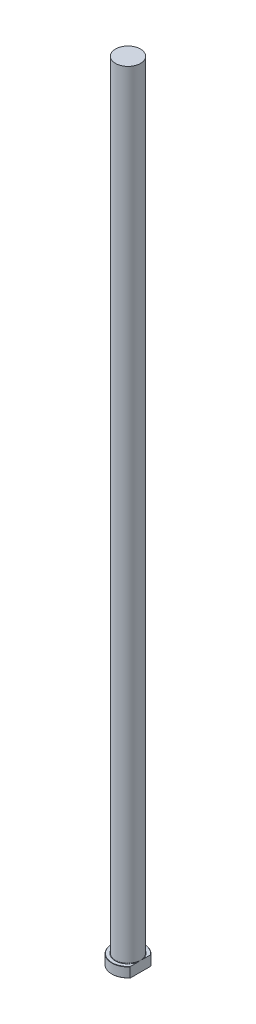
ISO-10303-21;
HEADER;
FILE_DESCRIPTION(('STEP AP214'),'2;1');
FILE_NAME('part.step','',(''),(''),'','','');
FILE_SCHEMA(('AUTOMOTIVE_DESIGN { 1 0 10303 214 1 1 1 1 }'));
ENDSEC;
DATA;
#1=APPLICATION_CONTEXT('core data for automotive mechanical design processes');
#2=APPLICATION_PROTOCOL_DEFINITION('international standard','automotive_design',2000,#1);
#3=PRODUCT_CONTEXT('',#1,'mechanical');
#4=PRODUCT('Part','Part','',(#3));
#5=PRODUCT_RELATED_PRODUCT_CATEGORY('part','',(#4));
#6=PRODUCT_DEFINITION_FORMATION('','',#4);
#7=PRODUCT_DEFINITION_CONTEXT('part definition',#1,'design');
#8=PRODUCT_DEFINITION('design','',#6,#7);
#9=PRODUCT_DEFINITION_SHAPE('','',#8);
#10=(LENGTH_UNIT() NAMED_UNIT(*) SI_UNIT(.MILLI.,.METRE.));
#11=(NAMED_UNIT(*) PLANE_ANGLE_UNIT() SI_UNIT($,.RADIAN.));
#12=(NAMED_UNIT(*) SI_UNIT($,.STERADIAN.) SOLID_ANGLE_UNIT());
#13=UNCERTAINTY_MEASURE_WITH_UNIT(LENGTH_MEASURE(1.E-05),#10,'distance_accuracy_value','');
#14=(GEOMETRIC_REPRESENTATION_CONTEXT(3) GLOBAL_UNCERTAINTY_ASSIGNED_CONTEXT((#13)) GLOBAL_UNIT_ASSIGNED_CONTEXT((#10,
#11,#12)) REPRESENTATION_CONTEXT('',''));
#15=CARTESIAN_POINT('',(0.,0.,0.));
#16=DIRECTION('',(0.,0.,1.));
#17=DIRECTION('',(1.,0.,0.));
#18=AXIS2_PLACEMENT_3D('',#15,#16,#17);
#19=CARTESIAN_POINT('',(0.,0.,0.));
#20=DIRECTION('',(0.,-1.,0.));
#21=DIRECTION('',(0.,0.,-1.));
#22=AXIS2_PLACEMENT_3D('',#19,#20,#21);
#23=PLANE('',#22);
#24=CARTESIAN_POINT('',(0.,0.,0.));
#25=DIRECTION('',(0.,-1.,0.));
#26=DIRECTION('',(0.,0.,-1.));
#27=AXIS2_PLACEMENT_3D('',#24,#25,#26);
#28=CIRCLE('',#27,12.8);
#29=CARTESIAN_POINT('',(9.99999999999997,0.,7.98999374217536));
#30=VERTEX_POINT('',#29);
#31=CARTESIAN_POINT('',(9.99999999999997,0.,-7.98999374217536));
#32=VERTEX_POINT('',#31);
#33=EDGE_CURVE('E98',#30,#32,#28,.T.);
#34=ORIENTED_EDGE('',*,*,#33,.T.);
#35=DIRECTION('',(0.,0.,1.));
#36=VECTOR('',#35,1.);
#37=CARTESIAN_POINT('',(9.99999999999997,0.,-8.30662386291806));
#38=LINE('',#37,#36);
#39=EDGE_CURVE('E83',#32,#30,#38,.T.);
#40=ORIENTED_EDGE('',*,*,#39,.T.);
#41=EDGE_LOOP('',(#34,#40));
#42=FACE_BOUND('',#41,.T.);
#43=ADVANCED_FACE('F32',(#42),#23,.T.);
#44=CARTESIAN_POINT('',(0.,259.958771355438,0.));
#45=DIRECTION('',(0.,1.,0.));
#46=DIRECTION('',(0.,0.,1.));
#47=AXIS2_PLACEMENT_3D('',#44,#45,#46);
#48=CYLINDRICAL_SURFACE('',#47,13.);
#49=CARTESIAN_POINT('',(0.,7.79999999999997,0.));
#50=DIRECTION('',(0.,1.,0.));
#51=DIRECTION('',(0.,0.,1.));
#52=AXIS2_PLACEMENT_3D('',#49,#50,#51);
#53=CIRCLE('',#52,13.);
#54=CARTESIAN_POINT('',(9.99999999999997,7.79999999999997,8.30662386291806));
#55=VERTEX_POINT('',#54);
#56=CARTESIAN_POINT('',(9.99999999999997,7.79999999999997,-8.30662386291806));
#57=VERTEX_POINT('',#56);
#58=EDGE_CURVE('E104',#55,#57,#53,.F.);
#59=ORIENTED_EDGE('',*,*,#58,.T.);
#60=DIRECTION('',(0.,-1.,0.));
#61=VECTOR('',#60,1.);
#62=CARTESIAN_POINT('',(9.99999999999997,630.,-8.30662386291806));
#63=LINE('',#62,#61);
#64=CARTESIAN_POINT('',(9.99999999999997,0.199999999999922,-8.30662386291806));
#65=VERTEX_POINT('',#64);
#66=EDGE_CURVE('E183',#57,#65,#63,.T.);
#67=ORIENTED_EDGE('',*,*,#66,.T.);
#68=CARTESIAN_POINT('',(0.,0.199999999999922,0.));
#69=DIRECTION('',(0.,-1.,0.));
#70=DIRECTION('',(0.,0.,-1.));
#71=AXIS2_PLACEMENT_3D('',#68,#69,#70);
#72=CIRCLE('',#71,13.);
#73=CARTESIAN_POINT('',(9.99999999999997,0.199999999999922,8.30662386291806));
#74=VERTEX_POINT('',#73);
#75=EDGE_CURVE('E100',#65,#74,#72,.F.);
#76=ORIENTED_EDGE('',*,*,#75,.T.);
#77=DIRECTION('',(0.,-1.,0.));
#78=VECTOR('',#77,1.);
#79=CARTESIAN_POINT('',(9.99999999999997,630.,8.30662386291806));
#80=LINE('',#79,#78);
#81=EDGE_CURVE('E93',#55,#74,#80,.T.);
#82=ORIENTED_EDGE('',*,*,#81,.F.);
#83=EDGE_LOOP('',(#59,#67,#76,#82));
#84=FACE_BOUND('',#83,.T.);
#85=ADVANCED_FACE('F158',(#84),#48,.T.);
#86=CARTESIAN_POINT('',(-13.,8.,0.));
#87=DIRECTION('',(0.,1.,0.));
#88=DIRECTION('',(0.,0.,1.));
#89=AXIS2_PLACEMENT_3D('',#86,#87,#88);
#90=PLANE('',#89);
#91=CARTESIAN_POINT('',(0.,8.,0.));
#92=DIRECTION('',(0.,1.,0.));
#93=DIRECTION('',(0.,0.,1.));
#94=AXIS2_PLACEMENT_3D('',#91,#92,#93);
#95=CIRCLE('',#94,12.8);
#96=CARTESIAN_POINT('',(9.99999999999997,8.,-7.98999374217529));
#97=VERTEX_POINT('',#96);
#98=CARTESIAN_POINT('',(9.99999999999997,8.,7.98999374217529));
#99=VERTEX_POINT('',#98);
#100=EDGE_CURVE('E178',#97,#99,#95,.T.);
#101=ORIENTED_EDGE('',*,*,#100,.T.);
#102=DIRECTION('',(0.,0.,-1.));
#103=VECTOR('',#102,1.);
#104=CARTESIAN_POINT('',(9.99999999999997,8.,0.));
#105=LINE('',#104,#103);
#106=CARTESIAN_POINT('',(9.99999999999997,7.99999999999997,2.46779253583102));
#107=VERTEX_POINT('',#106);
#108=EDGE_CURVE('E57',#99,#107,#105,.T.);
#109=ORIENTED_EDGE('',*,*,#108,.T.);
#110=CARTESIAN_POINT('',(0.,8.,0.));
#111=DIRECTION('',(0.,1.,0.));
#112=DIRECTION('',(0.,0.,1.));
#113=AXIS2_PLACEMENT_3D('',#110,#111,#112);
#114=CIRCLE('',#113,10.3);
#115=CARTESIAN_POINT('',(9.99999999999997,7.99999999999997,-2.4677925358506));
#116=VERTEX_POINT('',#115);
#117=EDGE_CURVE('E107',#107,#116,#114,.F.);
#118=ORIENTED_EDGE('',*,*,#117,.T.);
#119=EDGE_CURVE('E136',#116,#97,#105,.T.);
#120=ORIENTED_EDGE('',*,*,#119,.T.);
#121=EDGE_LOOP('',(#101,#109,#118,#120));
#122=FACE_BOUND('',#121,.T.);
#123=ADVANCED_FACE('F147',(#122),#90,.T.);
#124=CARTESIAN_POINT('',(0.,8.00000000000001,0.));
#125=DIRECTION('',(0.,-1.,0.));
#126=DIRECTION('',(0.,0.,-1.));
#127=AXIS2_PLACEMENT_3D('',#124,#125,#126);
#128=CONICAL_SURFACE('',#127,12.8,0.78539816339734);
#129=ORIENTED_EDGE('',*,*,#58,.F.);
#130=CARTESIAN_POINT('',(9.99999999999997,-0.0325156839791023,18.2754947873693));
#131=CARTESIAN_POINT('',(9.99999999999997,0.202654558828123,18.0074110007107));
#132=CARTESIAN_POINT('',(9.99999999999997,0.437161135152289,17.7387434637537));
#133=CARTESIAN_POINT('',(9.99999999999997,0.90465320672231,17.2000818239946));
#134=CARTESIAN_POINT('',(9.99999999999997,1.1376386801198,16.9300877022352));
#135=CARTESIAN_POINT('',(9.99999999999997,1.60198918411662,16.3885035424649));
#136=CARTESIAN_POINT('',(9.99999999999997,1.83335346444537,16.1169128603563));
#137=CARTESIAN_POINT('',(9.99999999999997,2.29410614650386,15.5720644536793));
#138=CARTESIAN_POINT('',(9.99999999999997,2.52349455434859,15.2988067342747));
#139=CARTESIAN_POINT('',(9.99999999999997,3.21725580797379,14.465453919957));
#140=CARTESIAN_POINT('',(9.99999999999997,3.67808931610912,13.9023903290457));
#141=CARTESIAN_POINT('',(9.99999999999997,4.35978968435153,13.0502618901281));
#142=CARTESIAN_POINT('',(9.99999999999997,4.58540795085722,12.7649943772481));
#143=CARTESIAN_POINT('',(9.99999999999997,5.03290011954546,12.1915402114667));
#144=CARTESIAN_POINT('',(9.99999999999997,5.25477408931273,11.9033536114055));
#145=CARTESIAN_POINT('',(9.99999999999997,5.69431250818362,11.3233226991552));
#146=CARTESIAN_POINT('',(9.99999999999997,5.91197246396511,11.0314749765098));
#147=CARTESIAN_POINT('',(9.99999999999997,6.3419766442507,10.4438760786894));
#148=CARTESIAN_POINT('',(9.99999999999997,6.55432081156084,10.1481248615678));
#149=CARTESIAN_POINT('',(9.99999999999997,6.97275454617,9.55185224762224));
#150=CARTESIAN_POINT('',(9.99999999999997,7.1788387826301,9.25132709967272));
#151=CARTESIAN_POINT('',(9.99999999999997,7.58314110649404,8.6450223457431));
#152=CARTESIAN_POINT('',(9.99999999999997,7.78135936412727,8.33924285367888));
#153=CARTESIAN_POINT('',(9.99999999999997,8.1669913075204,7.72335702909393));
#154=CARTESIAN_POINT('',(9.99999999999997,8.35446043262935,7.41328556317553));
#155=CARTESIAN_POINT('',(9.99999999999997,8.71750578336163,6.78616658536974));
#156=CARTESIAN_POINT('',(9.99999999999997,8.89308056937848,6.46911823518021));
#157=CARTESIAN_POINT('',(9.99999999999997,9.22907765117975,5.82759086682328));
#158=CARTESIAN_POINT('',(9.99999999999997,9.38952050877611,5.50312269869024));
#159=CARTESIAN_POINT('',(9.99999999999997,9.69166927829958,4.84563633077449));
#160=CARTESIAN_POINT('',(9.99999999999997,9.83338220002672,4.5126213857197));
#161=CARTESIAN_POINT('',(9.99999999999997,10.096522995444,3.82962418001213));
#162=CARTESIAN_POINT('',(9.99999999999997,10.2174003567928,3.47942732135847));
#163=CARTESIAN_POINT('',(9.99999999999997,10.4289934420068,2.76986167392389));
#164=CARTESIAN_POINT('',(9.99999999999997,10.5197138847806,2.41049432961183));
#165=CARTESIAN_POINT('',(9.99999999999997,10.6286544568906,1.86748514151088));
#166=CARTESIAN_POINT('',(9.99999999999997,10.6603769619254,1.68649705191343));
#167=CARTESIAN_POINT('',(9.99999999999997,10.7144435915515,1.32313476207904));
#168=CARTESIAN_POINT('',(9.99999999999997,10.7367891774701,1.14076078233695));
#169=CARTESIAN_POINT('',(9.99999999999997,10.7716587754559,0.775084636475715));
#170=CARTESIAN_POINT('',(9.99999999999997,10.7841833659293,0.591782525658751));
#171=CARTESIAN_POINT('',(9.99999999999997,10.7991548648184,0.224764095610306));
#172=CARTESIAN_POINT('',(9.99999999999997,10.8016017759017,0.0410477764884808));
#173=CARTESIAN_POINT('',(9.99999999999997,10.7963538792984,-0.32701731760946));
#174=CARTESIAN_POINT('',(9.99999999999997,10.7886160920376,-0.511365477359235));
#175=CARTESIAN_POINT('',(9.99999999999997,10.7630873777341,-0.879387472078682));
#176=CARTESIAN_POINT('',(9.99999999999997,10.7452949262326,-1.06306120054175));
#177=CARTESIAN_POINT('',(9.99999999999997,10.7000178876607,-1.42920996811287));
#178=CARTESIAN_POINT('',(9.99999999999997,10.6725330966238,-1.61168498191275));
#179=CARTESIAN_POINT('',(9.99999999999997,10.6083992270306,-1.97502817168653));
#180=CARTESIAN_POINT('',(9.99999999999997,10.5717486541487,-2.15589608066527));
#181=CARTESIAN_POINT('',(9.99999999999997,10.4483311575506,-2.69844589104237));
#182=CARTESIAN_POINT('',(9.99999999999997,10.3484702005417,-3.0571987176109));
#183=CARTESIAN_POINT('',(9.99999999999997,10.1199208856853,-3.76518322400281));
#184=CARTESIAN_POINT('',(9.99999999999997,9.99123071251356,-4.11441430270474));
#185=CARTESIAN_POINT('',(9.99999999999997,9.68849468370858,-4.85781703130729));
#186=CARTESIAN_POINT('',(9.99999999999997,9.51049481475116,-5.25036497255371));
#187=CARTESIAN_POINT('',(9.99999999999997,9.13067200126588,-6.0238543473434));
#188=CARTESIAN_POINT('',(9.99999999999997,8.92883580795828,-6.40478917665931));
#189=CARTESIAN_POINT('',(9.99999999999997,8.50660482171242,-7.15714025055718));
#190=CARTESIAN_POINT('',(9.99999999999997,8.28617401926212,-7.52853612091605));
#191=CARTESIAN_POINT('',(9.99999999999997,7.83133827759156,-8.26251132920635));
#192=CARTESIAN_POINT('',(9.99999999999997,7.59693601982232,-8.62509234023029));
#193=CARTESIAN_POINT('',(9.99999999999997,7.11586721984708,-9.34492022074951));
#194=CARTESIAN_POINT('',(9.99999999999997,6.86913954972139,-9.7021260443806));
#195=CARTESIAN_POINT('',(9.99999999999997,6.36695123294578,-10.4103413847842));
#196=CARTESIAN_POINT('',(9.99999999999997,6.11149026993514,-10.7613506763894));
#197=CARTESIAN_POINT('',(9.99999999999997,5.59387477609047,-11.4577672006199));
#198=CARTESIAN_POINT('',(9.99999999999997,5.33172815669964,-11.803180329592));
#199=CARTESIAN_POINT('',(9.99999999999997,4.80177954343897,-12.4896197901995));
#200=CARTESIAN_POINT('',(9.99999999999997,4.53397765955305,-12.8306462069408));
#201=CARTESIAN_POINT('',(9.99999999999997,3.91508653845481,-13.6077378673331));
#202=CARTESIAN_POINT('',(9.99999999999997,3.56244770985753,-14.0425677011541));
#203=CARTESIAN_POINT('',(9.99999999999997,2.85099084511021,-14.9072873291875));
#204=CARTESIAN_POINT('',(9.99999999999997,2.49217148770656,-15.3371760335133));
#205=CARTESIAN_POINT('',(9.99999999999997,1.77449197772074,-16.1870689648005));
#206=CARTESIAN_POINT('',(9.99999999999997,1.41569709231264,-16.607128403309));
#207=CARTESIAN_POINT('',(9.99999999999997,0.694277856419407,-17.4437464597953));
#208=CARTESIAN_POINT('',(9.99999999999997,0.331654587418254,-17.8603060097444));
#209=CARTESIAN_POINT('',(9.99999999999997,-0.0325156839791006,-18.2754947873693));
#210=B_SPLINE_CURVE_WITH_KNOTS('',3,(#130,#131,#132,#133,#134,#135,#136,#137,#138,#139,#140,
#141,#142,#143,#144,#145,#146,#147,#148,#149,#150,#151,#152,#153,#154,#155,#156,#157,#158,#159,
#160,#161,#162,#163,#164,#165,#166,#167,#168,#169,#170,#171,#172,#173,#174,#175,#176,#177,#178,
#179,#180,#181,#182,#183,#184,#185,#186,#187,#188,#189,#190,#191,#192,#193,#194,#195,#196,#197,
#198,#199,#200,#201,#202,#203,#204,#205,#206,#207,#208,#209),.UNSPECIFIED.,.F.,.F.,(4,2,2,2,2,2,
2,2,2,2,2,2,2,2,2,2,2,2,2,2,2,2,2,2,2,2,2,2,2,2,2,2,2,2,2,2,2,2,2,4),(0.,1.06984422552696,
2.13970378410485,3.21002948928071,4.28035188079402,6.46299853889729,7.55408928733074,
8.64516032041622,9.73733693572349,10.8295252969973,11.9226190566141,13.0156891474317,
14.1024911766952,15.1894245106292,16.2748589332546,17.3598859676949,18.4702319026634,
19.5804040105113,20.1314403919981,20.6823908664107,21.2333088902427,21.7842267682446,
22.3374769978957,22.890811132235,23.4441569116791,23.9975929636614,25.1131246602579,
26.2287266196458,27.520697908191,28.8133907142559,30.1086470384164,31.4036555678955,
32.7058891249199,34.0081699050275,35.3089752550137,36.6097553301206,38.2892289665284,
39.9690662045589,41.6263430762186,43.2831636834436),.UNSPECIFIED.);
#211=EDGE_CURVE('E135',#55,#99,#210,.T.);
#212=ORIENTED_EDGE('',*,*,#211,.T.);
#213=ORIENTED_EDGE('',*,*,#100,.F.);
#214=EDGE_CURVE('E127',#97,#57,#210,.T.);
#215=ORIENTED_EDGE('',*,*,#214,.T.);
#216=EDGE_LOOP('',(#129,#212,#213,#215));
#217=FACE_BOUND('',#216,.T.);
#218=ADVANCED_FACE('F143',(#217),#128,.T.);
#219=CARTESIAN_POINT('',(0.,0.199999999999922,0.));
#220=DIRECTION('',(0.,1.,0.));
#221=DIRECTION('',(0.,0.,1.));
#222=AXIS2_PLACEMENT_3D('',#219,#220,#221);
#223=CONICAL_SURFACE('',#222,13.,0.785398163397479);
#224=ORIENTED_EDGE('',*,*,#75,.F.);
#225=CARTESIAN_POINT('',(9.99999999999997,8.03251568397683,-18.2754947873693));
#226=CARTESIAN_POINT('',(9.99999999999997,7.79734544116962,-18.0074110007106));
#227=CARTESIAN_POINT('',(9.99999999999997,7.56283886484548,-17.7387434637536));
#228=CARTESIAN_POINT('',(9.99999999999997,7.0953467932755,-17.2000818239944));
#229=CARTESIAN_POINT('',(9.99999999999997,6.86236131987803,-16.930087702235));
#230=CARTESIAN_POINT('',(9.99999999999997,6.39801081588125,-16.3885035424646));
#231=CARTESIAN_POINT('',(9.99999999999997,6.16664653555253,-16.1169128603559));
#232=CARTESIAN_POINT('',(9.99999999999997,5.70589385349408,-15.5720644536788));
#233=CARTESIAN_POINT('',(9.99999999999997,5.47650544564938,-15.2988067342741));
#234=CARTESIAN_POINT('',(9.99999999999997,4.78274419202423,-14.4654539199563));
#235=CARTESIAN_POINT('',(9.99999999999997,4.32191068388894,-13.9023903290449));
#236=CARTESIAN_POINT('',(9.99999999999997,3.64021031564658,-13.050261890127));
#237=CARTESIAN_POINT('',(9.99999999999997,3.41459204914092,-12.764994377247));
#238=CARTESIAN_POINT('',(9.99999999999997,2.96709988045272,-12.1915402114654));
#239=CARTESIAN_POINT('',(9.99999999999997,2.74522591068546,-11.9033536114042));
#240=CARTESIAN_POINT('',(9.99999999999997,2.30568749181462,-11.3233226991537));
#241=CARTESIAN_POINT('',(9.99999999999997,2.08802753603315,-11.0314749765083));
#242=CARTESIAN_POINT('',(9.99999999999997,1.65802335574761,-10.4438760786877));
#243=CARTESIAN_POINT('',(9.99999999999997,1.4456791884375,-10.1481248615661));
#244=CARTESIAN_POINT('',(9.99999999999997,1.0272454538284,-9.55185224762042));
#245=CARTESIAN_POINT('',(9.99999999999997,0.821161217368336,-9.25132709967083));
#246=CARTESIAN_POINT('',(9.99999999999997,0.416858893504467,-8.64502234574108));
#247=CARTESIAN_POINT('',(9.99999999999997,0.218640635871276,-8.33924285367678));
#248=CARTESIAN_POINT('',(9.99999999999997,-0.166991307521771,-7.72335702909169));
#249=CARTESIAN_POINT('',(9.99999999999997,-0.354460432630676,-7.41328556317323));
#250=CARTESIAN_POINT('',(9.99999999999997,-0.717505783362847,-6.78616658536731));
#251=CARTESIAN_POINT('',(9.99999999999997,-0.893080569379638,-6.46911823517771));
#252=CARTESIAN_POINT('',(9.99999999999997,-1.22907765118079,-5.82759086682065));
#253=CARTESIAN_POINT('',(9.99999999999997,-1.38952050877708,-5.50312269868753));
#254=CARTESIAN_POINT('',(9.99999999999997,-1.6916692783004,-4.84563633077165));
#255=CARTESIAN_POINT('',(9.99999999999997,-1.83338220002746,-4.5126213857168));
#256=CARTESIAN_POINT('',(9.99999999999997,-2.09652299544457,-3.82962418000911));
#257=CARTESIAN_POINT('',(9.99999999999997,-2.21740035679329,-3.47942732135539));
#258=CARTESIAN_POINT('',(9.99999999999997,-2.42899344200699,-2.76986167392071));
#259=CARTESIAN_POINT('',(9.99999999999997,-2.51971388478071,-2.41049432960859));
#260=CARTESIAN_POINT('',(9.99999999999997,-2.62865445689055,-1.86748514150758));
#261=CARTESIAN_POINT('',(9.99999999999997,-2.66037696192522,-1.68649705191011));
#262=CARTESIAN_POINT('',(9.99999999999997,-2.71444359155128,-1.32313476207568));
#263=CARTESIAN_POINT('',(9.99999999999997,-2.73678917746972,-1.14076078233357));
#264=CARTESIAN_POINT('',(9.99999999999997,-2.77165877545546,-0.775084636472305));
#265=CARTESIAN_POINT('',(9.99999999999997,-2.78418336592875,-0.591782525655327));
#266=CARTESIAN_POINT('',(9.99999999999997,-2.79915486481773,-0.224764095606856));
#267=CARTESIAN_POINT('',(9.99999999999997,-2.80160177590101,-0.0410477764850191));
#268=CARTESIAN_POINT('',(9.99999999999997,-2.79635387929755,0.327017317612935));
#269=CARTESIAN_POINT('',(9.99999999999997,-2.78861609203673,0.51136547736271));
#270=CARTESIAN_POINT('',(9.99999999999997,-2.76308737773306,0.879387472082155));
#271=CARTESIAN_POINT('',(9.99999999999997,-2.74529492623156,1.06306120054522));
#272=CARTESIAN_POINT('',(9.99999999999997,-2.70001788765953,1.42920996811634));
#273=CARTESIAN_POINT('',(9.99999999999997,-2.6725330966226,1.61168498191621));
#274=CARTESIAN_POINT('',(9.99999999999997,-2.60839922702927,1.97502817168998));
#275=CARTESIAN_POINT('',(9.99999999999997,-2.57174865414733,2.15589608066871));
#276=CARTESIAN_POINT('',(9.99999999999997,-2.4483311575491,2.69844589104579));
#277=CARTESIAN_POINT('',(9.99999999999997,-2.34847020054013,3.0571987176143));
#278=CARTESIAN_POINT('',(9.99999999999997,-2.11992088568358,3.76518322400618));
#279=CARTESIAN_POINT('',(9.99999999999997,-1.99123071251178,4.1144143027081));
#280=CARTESIAN_POINT('',(9.99999999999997,-1.6884946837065,4.85781703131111));
#281=CARTESIAN_POINT('',(9.99999999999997,-1.51049481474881,5.250364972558));
#282=CARTESIAN_POINT('',(9.99999999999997,-1.13067200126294,6.02385434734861));
#283=CARTESIAN_POINT('',(9.99999999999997,-0.928835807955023,6.40478917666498));
#284=CARTESIAN_POINT('',(9.99999999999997,-0.506604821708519,7.15714025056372));
#285=CARTESIAN_POINT('',(9.99999999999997,-0.286174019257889,7.52853612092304));
#286=CARTESIAN_POINT('',(9.99999999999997,0.168661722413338,8.2625113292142));
#287=CARTESIAN_POINT('',(9.99999999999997,0.403063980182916,8.62509234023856));
#288=CARTESIAN_POINT('',(9.99999999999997,0.884132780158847,9.34492022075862));
#289=CARTESIAN_POINT('',(9.99999999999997,1.13086045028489,9.70212604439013));
#290=CARTESIAN_POINT('',(9.99999999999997,1.63304876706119,10.4103413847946));
#291=CARTESIAN_POINT('',(9.99999999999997,1.88850973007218,10.7613506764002));
#292=CARTESIAN_POINT('',(9.99999999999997,2.40612522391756,11.4577672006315));
#293=CARTESIAN_POINT('',(9.99999999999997,2.66827184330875,11.803180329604));
#294=CARTESIAN_POINT('',(9.99999999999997,3.19822045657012,12.4896197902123));
#295=CARTESIAN_POINT('',(9.99999999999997,3.4660223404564,12.8306462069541));
#296=CARTESIAN_POINT('',(9.99999999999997,4.08491346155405,13.6077378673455));
#297=CARTESIAN_POINT('',(9.99999999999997,4.43755229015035,14.0425677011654));
#298=CARTESIAN_POINT('',(9.99999999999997,5.14900915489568,14.9072873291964));
#299=CARTESIAN_POINT('',(9.99999999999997,5.50782851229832,15.337176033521));
#300=CARTESIAN_POINT('',(9.99999999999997,6.22550802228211,16.1870689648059));
#301=CARTESIAN_POINT('',(9.99999999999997,6.5843029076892,16.6071284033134));
#302=CARTESIAN_POINT('',(9.99999999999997,7.30572214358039,17.4437464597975));
#303=CARTESIAN_POINT('',(9.99999999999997,7.66834541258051,17.8603060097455));
#304=CARTESIAN_POINT('',(9.99999999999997,8.03251568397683,18.2754947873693));
#305=B_SPLINE_CURVE_WITH_KNOTS('',3,(#225,#226,#227,#228,#229,#230,#231,#232,#233,#234,#235,
#236,#237,#238,#239,#240,#241,#242,#243,#244,#245,#246,#247,#248,#249,#250,#251,#252,#253,#254,
#255,#256,#257,#258,#259,#260,#261,#262,#263,#264,#265,#266,#267,#268,#269,#270,#271,#272,#273,
#274,#275,#276,#277,#278,#279,#280,#281,#282,#283,#284,#285,#286,#287,#288,#289,#290,#291,#292,
#293,#294,#295,#296,#297,#298,#299,#300,#301,#302,#303,#304),.UNSPECIFIED.,.F.,.F.,(4,2,2,2,2,2,
2,2,2,2,2,2,2,2,2,2,2,2,2,2,2,2,2,2,2,2,2,2,2,2,2,2,2,2,2,2,2,2,2,4),(0.,1.06984422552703,
2.139703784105,3.21002948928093,4.28035188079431,6.4629985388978,7.55408928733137,
8.64516032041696,9.73733693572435,10.8295252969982,11.9226190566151,13.0156891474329,
14.1024911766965,15.1894245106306,16.274858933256,17.3598859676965,18.470231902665,
19.580404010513,20.1314403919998,20.6823908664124,21.2333088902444,21.7842267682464,
22.3374769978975,22.8908111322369,23.4441569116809,23.9975929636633,25.1131246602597,
26.2287266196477,27.5206979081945,28.813390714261,30.1086470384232,31.4036555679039,
32.7058891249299,34.0081699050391,35.308975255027,36.6097553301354,38.2892289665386,
39.9690662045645,41.6263430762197,43.2831636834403),.UNSPECIFIED.);
#306=EDGE_CURVE('E86',#65,#32,#305,.T.);
#307=ORIENTED_EDGE('',*,*,#306,.T.);
#308=ORIENTED_EDGE('',*,*,#33,.F.);
#309=EDGE_CURVE('E89',#30,#74,#305,.T.);
#310=ORIENTED_EDGE('',*,*,#309,.T.);
#311=EDGE_LOOP('',(#224,#307,#308,#310));
#312=FACE_BOUND('',#311,.T.);
#313=ADVANCED_FACE('F97',(#312),#223,.T.);
#314=CARTESIAN_POINT('',(0.,8.29999999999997,0.));
#315=DIRECTION('',(0.,1.,0.));
#316=DIRECTION('',(0.,0.,1.));
#317=AXIS2_PLACEMENT_3D('',#314,#315,#316);
#318=TOROIDAL_SURFACE('',#317,10.3,0.3);
#319=CARTESIAN_POINT('',(9.99999999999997,8.29999999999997,0.));
#320=CARTESIAN_POINT('',(9.99999999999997,8.3000006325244,1.2894927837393E-10));
#321=CARTESIAN_POINT('',(9.99999999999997,8.30000126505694,-4.00092931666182E-07));
#322=CARTESIAN_POINT('',(9.99999999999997,8.30000243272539,-1.40234418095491E-06));
#323=CARTESIAN_POINT('',(9.99999999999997,8.30000291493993,-2.02945823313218E-06));
#324=CARTESIAN_POINT('',(9.99999999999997,8.30000399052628,-3.57386628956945E-06));
#325=CARTESIAN_POINT('',(9.99999999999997,8.30000456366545,-4.5158581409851E-06));
#326=CARTESIAN_POINT('',(9.99999999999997,8.30000552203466,-6.39352358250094E-06));
#327=CARTESIAN_POINT('',(9.99999999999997,8.3000059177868,-7.32481303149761E-06));
#328=CARTESIAN_POINT('',(9.99999999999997,8.30000752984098,-1.11866731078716E-05));
#329=CARTESIAN_POINT('',(9.99999999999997,8.30000869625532,-1.41456078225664E-05));
#330=CARTESIAN_POINT('',(9.99999999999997,8.30001046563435,-1.98041770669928E-05));
#331=CARTESIAN_POINT('',(9.99999999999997,8.30001112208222,-2.2487618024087E-05));
#332=CARTESIAN_POINT('',(9.99999999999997,8.30001410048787,-3.44834818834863E-05));
#333=CARTESIAN_POINT('',(9.99999999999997,8.30001652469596,-4.37702043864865E-05));
#334=CARTESIAN_POINT('',(9.99999999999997,8.30001986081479,-6.08623690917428E-05));
#335=CARTESIAN_POINT('',(9.99999999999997,8.30002096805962,-6.86285921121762E-05));
#336=CARTESIAN_POINT('',(9.99999999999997,8.3000293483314,-0.00012805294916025));
#337=CARTESIAN_POINT('',(9.99999999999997,8.30003610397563,-0.000179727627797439));
#338=CARTESIAN_POINT('',(9.99999999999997,8.30006561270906,-0.00038619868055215));
#339=CARTESIAN_POINT('',(9.99999999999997,8.30009331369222,-0.000540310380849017));
#340=CARTESIAN_POINT('',(9.99999999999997,8.30020264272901,-0.00115673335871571));
#341=CARTESIAN_POINT('',(9.99999999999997,8.30028138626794,-0.00161935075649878));
#342=CARTESIAN_POINT('',(9.99999999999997,8.30059961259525,-0.00347761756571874));
#343=CARTESIAN_POINT('',(9.99999999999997,8.30084290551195,-0.0048728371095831));
#344=CARTESIAN_POINT('',(9.99999999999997,8.30186502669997,-0.0107472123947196));
#345=CARTESIAN_POINT('',(9.99999999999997,8.30263902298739,-0.0152269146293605));
#346=CARTESIAN_POINT('',(9.99999999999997,8.31278939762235,-0.0739588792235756));
#347=CARTESIAN_POINT('',(9.99999999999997,8.32219581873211,-0.128207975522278));
#348=CARTESIAN_POINT('',(9.99999999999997,8.34198671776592,-0.242894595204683));
#349=CARTESIAN_POINT('',(9.99999999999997,8.35236068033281,-0.303333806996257));
#350=CARTESIAN_POINT('',(9.99999999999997,8.3697713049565,-0.405616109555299));
#351=CARTESIAN_POINT('',(9.99999999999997,8.3768514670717,-0.447451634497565));
#352=CARTESIAN_POINT('',(9.99999999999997,8.39069208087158,-0.529918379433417));
#353=CARTESIAN_POINT('',(9.99999999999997,8.39745582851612,-0.570549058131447));
#354=CARTESIAN_POINT('',(9.99999999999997,8.4352494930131,-0.799879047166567));
#355=CARTESIAN_POINT('',(9.99999999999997,8.46492511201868,-0.988816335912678));
#356=CARTESIAN_POINT('',(9.99999999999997,8.50514159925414,-1.27416595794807));
#357=CARTESIAN_POINT('',(9.99999999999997,8.51790226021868,-1.37026272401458));
#358=CARTESIAN_POINT('',(9.99999999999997,8.54137601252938,-1.56269877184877));
#359=CARTESIAN_POINT('',(9.99999999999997,8.55208934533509,-1.65903802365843));
#360=CARTESIAN_POINT('',(9.99999999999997,8.57171635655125,-1.86082905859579));
#361=CARTESIAN_POINT('',(9.99999999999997,8.58037484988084,-1.96630619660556));
#362=CARTESIAN_POINT('',(9.99999999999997,8.59347501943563,-2.17764173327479));
#363=CARTESIAN_POINT('',(9.99999999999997,8.59791297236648,-2.28350038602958));
#364=CARTESIAN_POINT('',(9.99999999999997,8.60018116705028,-2.44194031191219));
#365=CARTESIAN_POINT('',(9.99999999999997,8.60021412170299,-2.49449016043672));
#366=CARTESIAN_POINT('',(9.99999999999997,8.5985468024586,-2.59955991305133));
#367=CARTESIAN_POINT('',(9.99999999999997,8.59684676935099,-2.65207982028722));
#368=CARTESIAN_POINT('',(9.99999999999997,8.59132943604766,-2.7569292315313));
#369=CARTESIAN_POINT('',(9.99999999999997,8.58751547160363,-2.80925890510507));
#370=CARTESIAN_POINT('',(9.99999999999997,8.57721394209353,-2.91364681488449));
#371=CARTESIAN_POINT('',(9.99999999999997,8.57072778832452,-2.96570517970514));
#372=CARTESIAN_POINT('',(9.99999999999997,8.55845909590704,-3.04236198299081));
#373=CARTESIAN_POINT('',(9.99999999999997,8.55406015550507,-3.06718232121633));
#374=CARTESIAN_POINT('',(9.99999999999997,8.54426309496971,-3.11664708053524));
#375=CARTESIAN_POINT('',(9.99999999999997,8.53886425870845,-3.14129136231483));
#376=CARTESIAN_POINT('',(9.99999999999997,8.52688550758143,-3.19015398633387));
#377=CARTESIAN_POINT('',(9.99999999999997,8.52031210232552,-3.21437390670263));
#378=CARTESIAN_POINT('',(9.99999999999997,8.50565284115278,-3.26234404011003));
#379=CARTESIAN_POINT('',(9.99999999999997,8.49756823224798,-3.2860946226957));
#380=CARTESIAN_POINT('',(9.99999999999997,8.47930616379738,-3.33303874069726));
#381=CARTESIAN_POINT('',(9.99999999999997,8.46910978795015,-3.35622496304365));
#382=CARTESIAN_POINT('',(9.99999999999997,8.44583688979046,-3.40109767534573));
#383=CARTESIAN_POINT('',(9.99999999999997,8.43277518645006,-3.4227911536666));
#384=CARTESIAN_POINT('',(9.99999999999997,8.41234422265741,-3.44947282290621));
#385=CARTESIAN_POINT('',(9.99999999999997,8.40696910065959,-3.45597309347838));
#386=CARTESIAN_POINT('',(9.99999999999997,8.39560437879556,-3.46843629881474));
#387=CARTESIAN_POINT('',(9.99999999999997,8.38961405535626,-3.47439858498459));
#388=CARTESIAN_POINT('',(9.99999999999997,8.37686927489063,-3.48560282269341));
#389=CARTESIAN_POINT('',(9.99999999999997,8.37010747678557,-3.49083658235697));
#390=CARTESIAN_POINT('',(9.99999999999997,8.3558159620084,-3.50012893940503));
#391=CARTESIAN_POINT('',(9.99999999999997,8.34828839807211,-3.50419071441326));
#392=CARTESIAN_POINT('',(9.99999999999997,8.33495256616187,-3.50966904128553));
#393=CARTESIAN_POINT('',(9.99999999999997,8.32932210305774,-3.5115146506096));
#394=CARTESIAN_POINT('',(9.99999999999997,8.31783314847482,-3.51424608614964));
#395=CARTESIAN_POINT('',(9.99999999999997,8.31197492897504,-3.5151330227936));
#396=CARTESIAN_POINT('',(9.99999999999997,8.30017128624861,-3.51585458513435));
#397=CARTESIAN_POINT('',(9.99999999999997,8.29422562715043,-3.5156854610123));
#398=CARTESIAN_POINT('',(9.99999999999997,8.28245600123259,-3.5143060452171));
#399=CARTESIAN_POINT('',(9.99999999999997,8.2766321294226,-3.51309496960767));
#400=CARTESIAN_POINT('',(9.99999999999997,8.26408629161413,-3.50941038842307));
#401=CARTESIAN_POINT('',(9.99999999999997,8.25742641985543,-3.50672823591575));
#402=CARTESIAN_POINT('',(9.99999999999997,8.2446282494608,-3.50032629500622));
#403=CARTESIAN_POINT('',(9.99999999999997,8.23849100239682,-3.49660447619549));
#404=CARTESIAN_POINT('',(9.99999999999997,8.22322836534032,-3.48593836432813));
#405=CARTESIAN_POINT('',(9.99999999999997,8.21452212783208,-3.47840118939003));
#406=CARTESIAN_POINT('',(9.99999999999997,8.19829740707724,-3.46215047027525));
#407=CARTESIAN_POINT('',(9.99999999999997,8.19078248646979,-3.45343353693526));
#408=CARTESIAN_POINT('',(9.99999999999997,8.16907103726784,-3.42543186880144));
#409=CARTESIAN_POINT('',(9.99999999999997,8.15646161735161,-3.40493410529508));
#410=CARTESIAN_POINT('',(9.99999999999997,8.13394130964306,-3.36256849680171));
#411=CARTESIAN_POINT('',(9.99999999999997,8.12403585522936,-3.34069800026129));
#412=CARTESIAN_POINT('',(9.99999999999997,8.10001076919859,-3.28102790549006));
#413=CARTESIAN_POINT('',(9.99999999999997,8.08762395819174,-3.24253659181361));
#414=CARTESIAN_POINT('',(9.99999999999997,8.06625855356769,-3.16459452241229));
#415=CARTESIAN_POINT('',(9.99999999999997,8.05728845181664,-3.12514163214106));
#416=CARTESIAN_POINT('',(9.99999999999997,8.04173697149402,-3.04517405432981));
#417=CARTESIAN_POINT('',(9.99999999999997,8.03519245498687,-3.00465227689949));
#418=CARTESIAN_POINT('',(9.99999999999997,8.02409415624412,-2.9234105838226));
#419=CARTESIAN_POINT('',(9.99999999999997,8.0195374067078,-2.8826910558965));
#420=CARTESIAN_POINT('',(9.99999999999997,8.00795421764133,-2.7573453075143));
#421=CARTESIAN_POINT('',(9.99999999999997,8.00352270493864,-2.67248037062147));
#422=CARTESIAN_POINT('',(9.99999999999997,7.9993551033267,-2.50262077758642));
#423=CARTESIAN_POINT('',(9.99999999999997,7.99962236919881,-2.41762607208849));
#424=CARTESIAN_POINT('',(9.99999999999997,8.00371104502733,-2.24733475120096));
#425=CARTESIAN_POINT('',(9.99999999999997,8.00754894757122,-2.16203856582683));
#426=CARTESIAN_POINT('',(9.99999999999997,8.01800314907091,-1.99161257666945));
#427=CARTESIAN_POINT('',(9.99999999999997,8.02461987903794,-1.90648280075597));
#428=CARTESIAN_POINT('',(9.99999999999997,8.04643179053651,-1.66587956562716));
#429=CARTESIAN_POINT('',(9.99999999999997,8.06418968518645,-1.51064125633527));
#430=CARTESIAN_POINT('',(9.99999999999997,8.10422160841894,-1.20249798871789));
#431=CARTESIAN_POINT('',(9.99999999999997,8.12644437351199,-1.04958602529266));
#432=CARTESIAN_POINT('',(9.99999999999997,8.15948239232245,-0.836243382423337));
#433=CARTESIAN_POINT('',(9.99999999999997,8.16909985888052,-0.775623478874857));
#434=CARTESIAN_POINT('',(9.99999999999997,8.18897079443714,-0.652687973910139));
#435=CARTESIAN_POINT('',(9.99999999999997,8.1992346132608,-0.590374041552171));
#436=CARTESIAN_POINT('',(9.99999999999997,8.21713663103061,-0.483134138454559));
#437=CARTESIAN_POINT('',(9.99999999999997,8.22471025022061,-0.438197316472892));
#438=CARTESIAN_POINT('',(9.99999999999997,8.2398772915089,-0.348851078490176));
#439=CARTESIAN_POINT('',(9.99999999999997,8.24746951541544,-0.30444145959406));
#440=CARTESIAN_POINT('',(9.99999999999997,8.26182028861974,-0.220832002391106));
#441=CARTESIAN_POINT('',(9.99999999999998,8.26857235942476,-0.181631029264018));
#442=CARTESIAN_POINT('',(9.99999999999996,8.28242621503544,-0.101524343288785));
#443=CARTESIAN_POINT('',(9.99999999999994,8.2895303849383,-0.0606190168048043));
#444=CARTESIAN_POINT('',(9.99999999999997,8.29736053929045,-0.0152203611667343));
#445=CARTESIAN_POINT('',(9.99999999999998,8.29813373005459,-0.0107340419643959));
#446=CARTESIAN_POINT('',(9.99999999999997,8.29916055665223,-0.00485912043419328));
#447=CARTESIAN_POINT('',(9.99999999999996,8.29940456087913,-0.00346907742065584));
#448=CARTESIAN_POINT('',(9.99999999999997,8.29971826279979,-0.00161621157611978));
#449=CARTESIAN_POINT('',(9.99999999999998,8.29979547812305,-0.00115451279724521));
#450=CARTESIAN_POINT('',(9.99999999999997,8.29990750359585,-0.000539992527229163));
#451=CARTESIAN_POINT('',(9.99999999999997,8.29993630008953,-0.00038627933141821));
#452=CARTESIAN_POINT('',(9.99999999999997,8.2999632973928,-0.000179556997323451));
#453=CARTESIAN_POINT('',(9.99999999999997,8.29996909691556,-0.000127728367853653));
#454=CARTESIAN_POINT('',(9.99999999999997,8.29998090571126,-5.92319127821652E-05));
#455=CARTESIAN_POINT('',(9.99999999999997,8.2999842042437,-4.21300594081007E-05));
#456=CARTESIAN_POINT('',(9.99999999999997,8.2999888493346,-2.24947629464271E-05));
#457=CARTESIAN_POINT('',(9.99999999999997,8.29998949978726,-1.98237694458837E-05));
#458=CARTESIAN_POINT('',(9.99999999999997,8.29999127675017,-1.4167154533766E-05));
#459=CARTESIAN_POINT('',(9.99999999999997,8.29999246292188,-1.11998611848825E-05));
#460=CARTESIAN_POINT('',(9.99999999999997,8.29999408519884,-7.32510164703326E-06));
#461=CARTESIAN_POINT('',(9.99999999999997,8.2999944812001,-6.39283781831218E-06));
#462=CARTESIAN_POINT('',(9.99999999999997,8.29999543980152,-4.51302258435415E-06));
#463=CARTESIAN_POINT('',(9.99999999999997,8.2999960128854,-3.56982568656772E-06));
#464=CARTESIAN_POINT('',(9.99999999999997,8.29999708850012,-2.02579406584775E-06));
#465=CARTESIAN_POINT('',(9.99999999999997,8.2999975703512,-1.39989048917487E-06));
#466=CARTESIAN_POINT('',(9.99999999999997,8.29999873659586,-3.99573162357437E-07));
#467=CARTESIAN_POINT('',(9.99999999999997,8.29999936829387,-1.2878245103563E-10));
#468=CARTESIAN_POINT('',(9.99999999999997,8.29999999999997,0.));
#469=B_SPLINE_CURVE_WITH_KNOTS('',3,(#319,#320,#321,#322,#323,#324,#325,#326,#327,#328,#329,
#330,#331,#332,#333,#334,#335,#336,#337,#338,#339,#340,#341,#342,#343,#344,#345,#346,#347,#348,
#349,#350,#351,#352,#353,#354,#355,#356,#357,#358,#359,#360,#361,#362,#363,#364,#365,#366,#367,
#368,#369,#370,#371,#372,#373,#374,#375,#376,#377,#378,#379,#380,#381,#382,#383,#384,#385,#386,
#387,#388,#389,#390,#391,#392,#393,#394,#395,#396,#397,#398,#399,#400,#401,#402,#403,#404,#405,
#406,#407,#408,#409,#410,#411,#412,#413,#414,#415,#416,#417,#418,#419,#420,#421,#422,#423,#424,
#425,#426,#427,#428,#429,#430,#431,#432,#433,#434,#435,#436,#437,#438,#439,#440,#441,#442,#443,
#444,#445,#446,#447,#448,#449,#450,#451,#452,#453,#454,#455,#456,#457,#458,#459,#460,#461,#462,
#463,#464,#465,#466,#467,#468),.UNSPECIFIED.,.T.,.F.,(4,2,2,2,2,2,2,2,2,2,2,2,2,2,2,2,2,2,2,2,2,
2,2,2,2,2,2,2,2,2,2,2,2,2,2,2,2,2,2,2,2,2,2,2,2,2,2,2,2,2,2,2,2,2,2,2,2,2,2,2,2,2,2,2,2,2,2,2,2,
2,2,2,2,2,4),(0.,1.98246532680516E-06,4.40569586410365E-06,7.67776729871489E-06,
1.071537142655E-05,2.02306846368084E-05,2.85109385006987E-05,5.727819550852E-05,
8.07917080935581E-05,0.000237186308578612,0.000706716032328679,0.00211476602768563,
0.00636329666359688,0.0200018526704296,0.18517497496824,0.369144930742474,0.496435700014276,
0.620005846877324,1.19369866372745,1.48450372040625,1.77527445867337,2.09271424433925,
2.41043381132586,2.56806178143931,2.72566785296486,2.88302592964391,3.04030100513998,
3.11590708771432,3.19156753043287,3.26682097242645,3.34201258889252,3.41790937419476,
3.49342251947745,3.51869744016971,3.54400243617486,3.56957226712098,3.5950721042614,
3.61277731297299,3.63046199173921,3.64820950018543,3.66597037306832,3.68738951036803,
3.70885077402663,3.74320167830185,3.77765344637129,3.84944920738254,3.92138819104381,
4.04238665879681,4.16368392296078,4.28675554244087,4.40964280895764,4.66436434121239,
4.91926774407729,5.17535440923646,5.43148080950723,5.90010007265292,6.36361828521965,
6.54775191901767,6.73721153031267,6.87392319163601,7.00908476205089,7.12841975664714,
7.25297120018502,7.26662883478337,7.27086249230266,7.27226698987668,7.27273594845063,
7.27289226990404,7.27294450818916,7.27295274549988,7.27296230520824,7.27296534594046,
7.27296862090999,7.27297104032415,7.27297302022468),.UNSPECIFIED.);
#470=CARTESIAN_POINT('',(9.99999999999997,8.29999999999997,0.));
#471=VERTEX_POINT('',#470);
#472=EDGE_CURVE('E11',#116,#471,#469,.T.);
#473=ORIENTED_EDGE('',*,*,#472,.F.);
#474=ORIENTED_EDGE('',*,*,#117,.F.);
#475=CARTESIAN_POINT('',(9.99999999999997,8.29999999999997,0.));
#476=CARTESIAN_POINT('',(9.99999999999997,8.29999936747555,-1.2894930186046E-10));
#477=CARTESIAN_POINT('',(9.99999999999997,8.29999873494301,4.0009293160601E-07));
#478=CARTESIAN_POINT('',(9.99999999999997,8.29999756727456,1.40234418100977E-06));
#479=CARTESIAN_POINT('',(9.99999999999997,8.29999708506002,2.02945823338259E-06));
#480=CARTESIAN_POINT('',(9.99999999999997,8.29999600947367,3.57386628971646E-06));
#481=CARTESIAN_POINT('',(9.99999999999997,8.2999954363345,4.51585814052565E-06));
#482=CARTESIAN_POINT('',(9.99999999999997,8.29999447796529,6.39352358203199E-06));
#483=CARTESIAN_POINT('',(9.99999999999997,8.29999408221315,7.32481303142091E-06));
#484=CARTESIAN_POINT('',(9.99999999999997,8.29999247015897,1.11866731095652E-05));
#485=CARTESIAN_POINT('',(9.99999999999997,8.29999130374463,1.41456078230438E-05));
#486=CARTESIAN_POINT('',(9.99999999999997,8.2999895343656,1.98041770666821E-05));
#487=CARTESIAN_POINT('',(9.99999999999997,8.29998887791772,2.24876180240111E-05));
#488=CARTESIAN_POINT('',(9.99999999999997,8.29998589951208,3.44834818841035E-05));
#489=CARTESIAN_POINT('',(9.99999999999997,8.29998347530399,4.3770204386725E-05));
#490=CARTESIAN_POINT('',(9.99999999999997,8.29998013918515,6.08623690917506E-05));
#491=CARTESIAN_POINT('',(9.99999999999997,8.29997903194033,6.8628592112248E-05));
#492=CARTESIAN_POINT('',(9.99999999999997,8.29997065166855,0.000128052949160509));
#493=CARTESIAN_POINT('',(9.99999999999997,8.29996389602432,0.000179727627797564));
#494=CARTESIAN_POINT('',(9.99999999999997,8.29993438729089,0.000386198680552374));
#495=CARTESIAN_POINT('',(9.99999999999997,8.29990668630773,0.000540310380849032));
#496=CARTESIAN_POINT('',(9.99999999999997,8.29979735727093,0.00115673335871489));
#497=CARTESIAN_POINT('',(9.99999999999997,8.29971861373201,0.00161935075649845));
#498=CARTESIAN_POINT('',(9.99999999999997,8.29940038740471,0.00347761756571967));
#499=CARTESIAN_POINT('',(9.99999999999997,8.299157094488,0.00487283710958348));
#500=CARTESIAN_POINT('',(9.99999999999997,8.29813497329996,0.0107472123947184));
#501=CARTESIAN_POINT('',(9.99999999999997,8.29736097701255,0.0152269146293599));
#502=CARTESIAN_POINT('',(9.99999999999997,8.28721060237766,0.0739588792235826));
#503=CARTESIAN_POINT('',(9.99999999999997,8.27780418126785,0.128207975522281));
#504=CARTESIAN_POINT('',(9.99999999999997,8.25801328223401,0.242894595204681));
#505=CARTESIAN_POINT('',(9.99999999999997,8.24763931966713,0.303333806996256));
#506=CARTESIAN_POINT('',(9.99999999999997,8.23022869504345,0.405616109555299));
#507=CARTESIAN_POINT('',(9.99999999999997,8.22314853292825,0.447451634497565));
#508=CARTESIAN_POINT('',(9.99999999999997,8.20930791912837,0.529918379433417));
#509=CARTESIAN_POINT('',(9.99999999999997,8.20254417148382,0.570549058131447));
#510=CARTESIAN_POINT('',(9.99999999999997,8.16475050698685,0.799879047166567));
#511=CARTESIAN_POINT('',(9.99999999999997,8.13507488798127,0.988816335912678));
#512=CARTESIAN_POINT('',(9.99999999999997,8.0948584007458,1.27416595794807));
#513=CARTESIAN_POINT('',(9.99999999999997,8.08209773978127,1.37026272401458));
#514=CARTESIAN_POINT('',(9.99999999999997,8.05862398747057,1.56269877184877));
#515=CARTESIAN_POINT('',(9.99999999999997,8.04791065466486,1.65903802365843));
#516=CARTESIAN_POINT('',(9.99999999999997,8.0282836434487,1.86082905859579));
#517=CARTESIAN_POINT('',(9.99999999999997,8.01962515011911,1.96630619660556));
#518=CARTESIAN_POINT('',(9.99999999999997,8.00652498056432,2.17764173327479));
#519=CARTESIAN_POINT('',(9.99999999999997,8.00208702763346,2.28350038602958));
#520=CARTESIAN_POINT('',(9.99999999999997,7.99981883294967,2.44194031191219));
#521=CARTESIAN_POINT('',(9.99999999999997,7.99978587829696,2.49449016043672));
#522=CARTESIAN_POINT('',(9.99999999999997,8.00145319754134,2.59955991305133));
#523=CARTESIAN_POINT('',(9.99999999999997,8.00315323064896,2.65207982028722));
#524=CARTESIAN_POINT('',(9.99999999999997,8.00867056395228,2.7569292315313));
#525=CARTESIAN_POINT('',(9.99999999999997,8.01248452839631,2.80925890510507));
#526=CARTESIAN_POINT('',(9.99999999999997,8.02278605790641,2.91364681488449));
#527=CARTESIAN_POINT('',(9.99999999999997,8.02927221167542,2.96570517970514));
#528=CARTESIAN_POINT('',(9.99999999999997,8.04154090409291,3.04236198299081));
#529=CARTESIAN_POINT('',(9.99999999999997,8.04593984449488,3.06718232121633));
#530=CARTESIAN_POINT('',(9.99999999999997,8.05573690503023,3.11664708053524));
#531=CARTESIAN_POINT('',(9.99999999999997,8.0611357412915,3.14129136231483));
#532=CARTESIAN_POINT('',(9.99999999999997,8.07311449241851,3.19015398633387));
#533=CARTESIAN_POINT('',(9.99999999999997,8.07968789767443,3.21437390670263));
#534=CARTESIAN_POINT('',(9.99999999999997,8.09434715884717,3.26234404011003));
#535=CARTESIAN_POINT('',(9.99999999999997,8.10243176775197,3.2860946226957));
#536=CARTESIAN_POINT('',(9.99999999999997,8.12069383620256,3.33303874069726));
#537=CARTESIAN_POINT('',(9.99999999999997,8.13089021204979,3.35622496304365));
#538=CARTESIAN_POINT('',(9.99999999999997,8.15416311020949,3.40109767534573));
#539=CARTESIAN_POINT('',(9.99999999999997,8.16722481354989,3.4227911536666));
#540=CARTESIAN_POINT('',(9.99999999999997,8.18765577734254,3.44947282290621));
#541=CARTESIAN_POINT('',(9.99999999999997,8.19303089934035,3.45597309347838));
#542=CARTESIAN_POINT('',(9.99999999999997,8.20439562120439,3.46843629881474));
#543=CARTESIAN_POINT('',(9.99999999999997,8.21038594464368,3.47439858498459));
#544=CARTESIAN_POINT('',(9.99999999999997,8.22313072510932,3.48560282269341));
#545=CARTESIAN_POINT('',(9.99999999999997,8.22989252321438,3.49083658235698));
#546=CARTESIAN_POINT('',(9.99999999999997,8.24418403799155,3.50012893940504));
#547=CARTESIAN_POINT('',(9.99999999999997,8.25171160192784,3.50419071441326));
#548=CARTESIAN_POINT('',(9.99999999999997,8.26504743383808,3.50966904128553));
#549=CARTESIAN_POINT('',(9.99999999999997,8.27067789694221,3.5115146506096));
#550=CARTESIAN_POINT('',(9.99999999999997,8.28216685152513,3.51424608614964));
#551=CARTESIAN_POINT('',(9.99999999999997,8.28802507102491,3.5151330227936));
#552=CARTESIAN_POINT('',(9.99999999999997,8.29982871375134,3.51585458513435));
#553=CARTESIAN_POINT('',(9.99999999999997,8.30577437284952,3.5156854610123));
#554=CARTESIAN_POINT('',(9.99999999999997,8.31754399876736,3.5143060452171));
#555=CARTESIAN_POINT('',(9.99999999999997,8.32336787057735,3.51309496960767));
#556=CARTESIAN_POINT('',(9.99999999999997,8.33591370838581,3.50941038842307));
#557=CARTESIAN_POINT('',(9.99999999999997,8.34257358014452,3.50672823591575));
#558=CARTESIAN_POINT('',(9.99999999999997,8.35537175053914,3.50032629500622));
#559=CARTESIAN_POINT('',(9.99999999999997,8.36150899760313,3.49660447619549));
#560=CARTESIAN_POINT('',(9.99999999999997,8.37677163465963,3.48593836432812));
#561=CARTESIAN_POINT('',(9.99999999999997,8.38547787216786,3.47840118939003));
#562=CARTESIAN_POINT('',(9.99999999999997,8.4017025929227,3.46215047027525));
#563=CARTESIAN_POINT('',(9.99999999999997,8.40921751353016,3.45343353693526));
#564=CARTESIAN_POINT('',(9.99999999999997,8.43092896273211,3.42543186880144));
#565=CARTESIAN_POINT('',(9.99999999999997,8.44353838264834,3.40493410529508));
#566=CARTESIAN_POINT('',(9.99999999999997,8.46605869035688,3.36256849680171));
#567=CARTESIAN_POINT('',(9.99999999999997,8.47596414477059,3.34069800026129));
#568=CARTESIAN_POINT('',(9.99999999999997,8.49998923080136,3.28102790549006));
#569=CARTESIAN_POINT('',(9.99999999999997,8.51237604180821,3.24253659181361));
#570=CARTESIAN_POINT('',(9.99999999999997,8.53374144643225,3.16459452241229));
#571=CARTESIAN_POINT('',(9.99999999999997,8.54271154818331,3.12514163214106));
#572=CARTESIAN_POINT('',(9.99999999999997,8.55826302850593,3.04517405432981));
#573=CARTESIAN_POINT('',(9.99999999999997,8.56480754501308,3.00465227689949));
#574=CARTESIAN_POINT('',(9.99999999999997,8.57590584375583,2.9234105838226));
#575=CARTESIAN_POINT('',(9.99999999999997,8.58046259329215,2.8826910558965));
#576=CARTESIAN_POINT('',(9.99999999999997,8.59204578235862,2.7573453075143));
#577=CARTESIAN_POINT('',(9.99999999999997,8.59647729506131,2.67248037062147));
#578=CARTESIAN_POINT('',(9.99999999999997,8.60064489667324,2.50262077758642));
#579=CARTESIAN_POINT('',(9.99999999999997,8.60037763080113,2.41762607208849));
#580=CARTESIAN_POINT('',(9.99999999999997,8.59628895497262,2.24733475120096));
#581=CARTESIAN_POINT('',(9.99999999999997,8.59245105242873,2.16203856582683));
#582=CARTESIAN_POINT('',(9.99999999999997,8.58199685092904,1.99161257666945));
#583=CARTESIAN_POINT('',(9.99999999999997,8.57538012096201,1.90648280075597));
#584=CARTESIAN_POINT('',(9.99999999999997,8.55356820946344,1.66587956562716));
#585=CARTESIAN_POINT('',(9.99999999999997,8.5358103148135,1.51064125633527));
#586=CARTESIAN_POINT('',(9.99999999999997,8.49577839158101,1.20249798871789));
#587=CARTESIAN_POINT('',(9.99999999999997,8.47355562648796,1.04958602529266));
#588=CARTESIAN_POINT('',(9.99999999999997,8.44051760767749,0.836243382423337));
#589=CARTESIAN_POINT('',(9.99999999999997,8.43090014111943,0.775623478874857));
#590=CARTESIAN_POINT('',(9.99999999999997,8.41102920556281,0.652687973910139));
#591=CARTESIAN_POINT('',(9.99999999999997,8.40076538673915,0.59037404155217));
#592=CARTESIAN_POINT('',(9.99999999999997,8.38286336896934,0.483134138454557));
#593=CARTESIAN_POINT('',(9.99999999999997,8.37528974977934,0.43819731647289));
#594=CARTESIAN_POINT('',(9.99999999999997,8.36012270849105,0.348851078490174));
#595=CARTESIAN_POINT('',(9.99999999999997,8.35253048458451,0.304441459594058));
#596=CARTESIAN_POINT('',(9.99999999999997,8.33817971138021,0.220832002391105));
#597=CARTESIAN_POINT('',(9.99999999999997,8.33142764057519,0.181631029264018));
#598=CARTESIAN_POINT('',(9.99999999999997,8.31757378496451,0.101524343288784));
#599=CARTESIAN_POINT('',(9.99999999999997,8.31046961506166,0.0606190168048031));
#600=CARTESIAN_POINT('',(9.99999999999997,8.3026394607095,0.0152203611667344));
#601=CARTESIAN_POINT('',(9.99999999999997,8.30186626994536,0.0107340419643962));
#602=CARTESIAN_POINT('',(9.99999999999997,8.30083944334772,0.0048591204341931));
#603=CARTESIAN_POINT('',(9.99999999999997,8.30059543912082,0.00346907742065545));
#604=CARTESIAN_POINT('',(9.99999999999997,8.30028173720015,0.00161621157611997));
#605=CARTESIAN_POINT('',(9.99999999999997,8.30020452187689,0.00115451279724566));
#606=CARTESIAN_POINT('',(9.99999999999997,8.3000924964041,0.000539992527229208));
#607=CARTESIAN_POINT('',(9.99999999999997,8.30006369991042,0.00038627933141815));
#608=CARTESIAN_POINT('',(9.99999999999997,8.30003670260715,0.000179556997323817));
#609=CARTESIAN_POINT('',(9.99999999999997,8.30003090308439,0.000127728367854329));
#610=CARTESIAN_POINT('',(9.99999999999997,8.30001909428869,5.92319127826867E-05));
#611=CARTESIAN_POINT('',(9.99999999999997,8.30001579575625,4.21300594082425E-05));
#612=CARTESIAN_POINT('',(9.99999999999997,8.30001115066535,2.24947629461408E-05));
#613=CARTESIAN_POINT('',(9.99999999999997,8.30001050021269,1.98237694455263E-05));
#614=CARTESIAN_POINT('',(9.99999999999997,8.30000872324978,1.41671545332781E-05));
#615=CARTESIAN_POINT('',(9.99999999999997,8.30000753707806,1.11998611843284E-05));
#616=CARTESIAN_POINT('',(9.99999999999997,8.30000591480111,7.32510164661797E-06));
#617=CARTESIAN_POINT('',(9.99999999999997,8.30000551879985,6.39283781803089E-06));
#618=CARTESIAN_POINT('',(9.99999999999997,8.30000456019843,4.51302258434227E-06));
#619=CARTESIAN_POINT('',(9.99999999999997,8.30000398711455,3.56982568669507E-06));
#620=CARTESIAN_POINT('',(9.99999999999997,8.30000291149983,2.02579406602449E-06));
#621=CARTESIAN_POINT('',(9.99999999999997,8.30000242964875,1.39989048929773E-06));
#622=CARTESIAN_POINT('',(9.99999999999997,8.30000126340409,3.99573162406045E-07));
#623=CARTESIAN_POINT('',(9.99999999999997,8.30000063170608,1.28782474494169E-10));
#624=CARTESIAN_POINT('',(9.99999999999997,8.29999999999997,0.));
#625=B_SPLINE_CURVE_WITH_KNOTS('',3,(#475,#476,#477,#478,#479,#480,#481,#482,#483,#484,#485,
#486,#487,#488,#489,#490,#491,#492,#493,#494,#495,#496,#497,#498,#499,#500,#501,#502,#503,#504,
#505,#506,#507,#508,#509,#510,#511,#512,#513,#514,#515,#516,#517,#518,#519,#520,#521,#522,#523,
#524,#525,#526,#527,#528,#529,#530,#531,#532,#533,#534,#535,#536,#537,#538,#539,#540,#541,#542,
#543,#544,#545,#546,#547,#548,#549,#550,#551,#552,#553,#554,#555,#556,#557,#558,#559,#560,#561,
#562,#563,#564,#565,#566,#567,#568,#569,#570,#571,#572,#573,#574,#575,#576,#577,#578,#579,#580,
#581,#582,#583,#584,#585,#586,#587,#588,#589,#590,#591,#592,#593,#594,#595,#596,#597,#598,#599,
#600,#601,#602,#603,#604,#605,#606,#607,#608,#609,#610,#611,#612,#613,#614,#615,#616,#617,#618,
#619,#620,#621,#622,#623,#624),.UNSPECIFIED.,.T.,.F.,(4,2,2,2,2,2,2,2,2,2,2,2,2,2,2,2,2,2,2,2,2,
2,2,2,2,2,2,2,2,2,2,2,2,2,2,2,2,2,2,2,2,2,2,2,2,2,2,2,2,2,2,2,2,2,2,2,2,2,2,2,2,2,2,2,2,2,2,2,2,
2,2,2,2,2,4),(0.,1.98246532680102E-06,4.4056958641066E-06,7.67776730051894E-06,
1.07153714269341E-05,2.02306846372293E-05,2.85109385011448E-05,5.72781955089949E-05,
8.07917080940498E-05,0.000237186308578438,0.000706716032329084,0.00211476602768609,
0.00636329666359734,0.0200018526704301,0.185174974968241,0.369144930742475,0.496435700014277,
0.620005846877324,1.19369866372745,1.48450372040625,1.77527445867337,2.09271424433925,
2.41043381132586,2.56806178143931,2.72566785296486,2.88302592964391,3.04030100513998,
3.11590708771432,3.19156753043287,3.26682097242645,3.34201258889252,3.41790937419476,
3.49342251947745,3.51869744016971,3.54400243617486,3.56957226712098,3.5950721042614,
3.61277731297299,3.63046199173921,3.64820950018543,3.66597037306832,3.68738951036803,
3.70885077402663,3.74320167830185,3.77765344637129,3.84944920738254,3.92138819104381,
4.04238665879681,4.16368392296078,4.28675554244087,4.40964280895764,4.66436434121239,
4.91926774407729,5.17535440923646,5.43148080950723,5.90010007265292,6.36361828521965,
6.54775191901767,6.73721153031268,6.87392319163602,7.00908476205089,7.12841975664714,
7.25297120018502,7.26662883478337,7.27086249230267,7.27226698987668,7.27273594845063,
7.27289226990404,7.27294450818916,7.27295274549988,7.27296230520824,7.27296534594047,
7.27296862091,7.27297104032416,7.27297302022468),.UNSPECIFIED.);
#626=EDGE_CURVE('E46',#471,#107,#625,.T.);
#627=ORIENTED_EDGE('',*,*,#626,.F.);
#628=CARTESIAN_POINT('',(0.,8.29999999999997,0.));
#629=DIRECTION('',(0.,1.,0.));
#630=DIRECTION('',(0.,0.,1.));
#631=AXIS2_PLACEMENT_3D('',#628,#629,#630);
#632=CIRCLE('',#631,9.99999999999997);
#633=EDGE_CURVE('E103',#471,#471,#632,.T.);
#634=ORIENTED_EDGE('',*,*,#633,.F.);
#635=EDGE_LOOP('',(#473,#474,#627,#634));
#636=FACE_BOUND('',#635,.T.);
#637=ADVANCED_FACE('F34',(#636),#318,.F.);
#638=CARTESIAN_POINT('',(0.,259.958771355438,0.));
#639=DIRECTION('',(0.,1.,0.));
#640=DIRECTION('',(0.,0.,1.));
#641=AXIS2_PLACEMENT_3D('',#638,#639,#640);
#642=CYLINDRICAL_SURFACE('',#641,9.99999999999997);
#643=ORIENTED_EDGE('',*,*,#633,.T.);
#644=EDGE_LOOP('',(#643));
#645=FACE_BOUND('',#644,.T.);
#646=CARTESIAN_POINT('',(0.,630.,0.));
#647=DIRECTION('',(0.,1.,0.));
#648=DIRECTION('',(0.,0.,1.));
#649=AXIS2_PLACEMENT_3D('',#646,#647,#648);
#650=CIRCLE('',#649,9.99999999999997);
#651=CARTESIAN_POINT('',(0.,630.,9.99999999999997));
#652=VERTEX_POINT('',#651);
#653=EDGE_CURVE('E101',#652,#652,#650,.T.);
#654=ORIENTED_EDGE('',*,*,#653,.F.);
#655=EDGE_LOOP('',(#654));
#656=FACE_BOUND('',#655,.T.);
#657=ADVANCED_FACE('F155',(#645,#656),#642,.T.);
#658=CARTESIAN_POINT('',(-9.99999999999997,630.,0.));
#659=DIRECTION('',(0.,1.,0.));
#660=DIRECTION('',(0.,0.,1.));
#661=AXIS2_PLACEMENT_3D('',#658,#659,#660);
#662=PLANE('',#661);
#663=ORIENTED_EDGE('',*,*,#653,.T.);
#664=EDGE_LOOP('',(#663));
#665=FACE_BOUND('',#664,.T.);
#666=ADVANCED_FACE('F121',(#665),#662,.T.);
#667=CARTESIAN_POINT('',(9.99999999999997,630.,-8.30662386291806));
#668=DIRECTION('',(1.,0.,0.));
#669=DIRECTION('',(0.,0.,-1.));
#670=AXIS2_PLACEMENT_3D('',#667,#668,#669);
#671=PLANE('',#670);
#672=ORIENTED_EDGE('',*,*,#66,.F.);
#673=ORIENTED_EDGE('',*,*,#214,.F.);
#674=ORIENTED_EDGE('',*,*,#119,.F.);
#675=ORIENTED_EDGE('',*,*,#472,.T.);
#676=ORIENTED_EDGE('',*,*,#626,.T.);
#677=ORIENTED_EDGE('',*,*,#108,.F.);
#678=ORIENTED_EDGE('',*,*,#211,.F.);
#679=ORIENTED_EDGE('',*,*,#81,.T.);
#680=ORIENTED_EDGE('',*,*,#309,.F.);
#681=ORIENTED_EDGE('',*,*,#39,.F.);
#682=ORIENTED_EDGE('',*,*,#306,.F.);
#683=EDGE_LOOP('',(#672,#673,#674,#675,#676,#677,#678,#679,#680,#681,#682));
#684=FACE_BOUND('',#683,.T.);
#685=ADVANCED_FACE('F85',(#684),#671,.T.);
#686=CLOSED_SHELL('',(#43,#85,#123,#218,#313,#637,#657,#666,#685));
#687=MANIFOLD_SOLID_BREP('B2',#686);
#688=ADVANCED_BREP_SHAPE_REPRESENTATION('',(#18,#687),#14);
#689=SHAPE_DEFINITION_REPRESENTATION(#9,#688);
ENDSEC;
END-ISO-10303-21;
